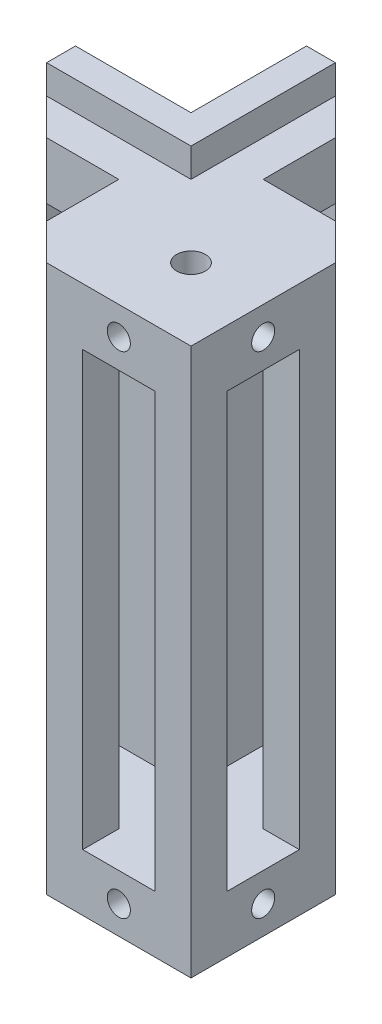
ISO-10303-21;
HEADER;
FILE_DESCRIPTION(('STEP AP214'),'2;1');
FILE_NAME('part.step','',(''),(''),'','','');
FILE_SCHEMA(('AUTOMOTIVE_DESIGN { 1 0 10303 214 1 1 1 1 }'));
ENDSEC;
DATA;
#1=APPLICATION_CONTEXT('core data for automotive mechanical design processes');
#2=APPLICATION_PROTOCOL_DEFINITION('international standard','automotive_design',2000,#1);
#3=PRODUCT_CONTEXT('',#1,'mechanical');
#4=PRODUCT('Part','Part','',(#3));
#5=PRODUCT_RELATED_PRODUCT_CATEGORY('part','',(#4));
#6=PRODUCT_DEFINITION_FORMATION('','',#4);
#7=PRODUCT_DEFINITION_CONTEXT('part definition',#1,'design');
#8=PRODUCT_DEFINITION('design','',#6,#7);
#9=PRODUCT_DEFINITION_SHAPE('','',#8);
#10=(LENGTH_UNIT() NAMED_UNIT(*) SI_UNIT(.MILLI.,.METRE.));
#11=(NAMED_UNIT(*) PLANE_ANGLE_UNIT() SI_UNIT($,.RADIAN.));
#12=(NAMED_UNIT(*) SI_UNIT($,.STERADIAN.) SOLID_ANGLE_UNIT());
#13=UNCERTAINTY_MEASURE_WITH_UNIT(LENGTH_MEASURE(1.E-05),#10,'distance_accuracy_value','');
#14=(GEOMETRIC_REPRESENTATION_CONTEXT(3) GLOBAL_UNCERTAINTY_ASSIGNED_CONTEXT((#13)) GLOBAL_UNIT_ASSIGNED_CONTEXT((#10,
#11,#12)) REPRESENTATION_CONTEXT('',''));
#15=CARTESIAN_POINT('',(0.,0.,0.));
#16=DIRECTION('',(0.,0.,1.));
#17=DIRECTION('',(1.,0.,0.));
#18=AXIS2_PLACEMENT_3D('',#15,#16,#17);
#19=CARTESIAN_POINT('',(2.5,-37.9,-7.5));
#20=DIRECTION('',(-1.,0.,0.));
#21=DIRECTION('',(0.,0.,1.));
#22=AXIS2_PLACEMENT_3D('',#19,#20,#21);
#23=PLANE('',#22);
#24=DIRECTION('',(0.,0.,1.));
#25=VECTOR('',#24,1.);
#26=CARTESIAN_POINT('',(2.5,-3.95,-20.));
#27=LINE('',#26,#25);
#28=CARTESIAN_POINT('',(2.5,-3.95,-12.));
#29=VERTEX_POINT('',#28);
#30=CARTESIAN_POINT('',(2.5,-3.95,-7.5));
#31=VERTEX_POINT('',#30);
#32=EDGE_CURVE('E435',#29,#31,#27,.T.);
#33=ORIENTED_EDGE('',*,*,#32,.T.);
#34=DIRECTION('',(0.,-1.,0.));
#35=VECTOR('',#34,1.);
#36=CARTESIAN_POINT('',(2.5,-37.9,-7.5));
#37=LINE('',#36,#35);
#38=CARTESIAN_POINT('',(2.5,-33.95,-7.5));
#39=VERTEX_POINT('',#38);
#40=EDGE_CURVE('E716',#31,#39,#37,.T.);
#41=ORIENTED_EDGE('',*,*,#40,.T.);
#42=DIRECTION('',(0.,0.,1.));
#43=VECTOR('',#42,1.);
#44=CARTESIAN_POINT('',(2.5,-33.95,-20.));
#45=LINE('',#44,#43);
#46=CARTESIAN_POINT('',(2.5,-33.95,-12.));
#47=VERTEX_POINT('',#46);
#48=EDGE_CURVE('E434',#47,#39,#45,.T.);
#49=ORIENTED_EDGE('',*,*,#48,.F.);
#50=DIRECTION('',(0.,1.,0.));
#51=VECTOR('',#50,1.);
#52=CARTESIAN_POINT('',(2.5,-39.9,-12.));
#53=LINE('',#52,#51);
#54=EDGE_CURVE('E337',#47,#29,#53,.T.);
#55=ORIENTED_EDGE('',*,*,#54,.T.);
#56=EDGE_LOOP('',(#33,#41,#49,#55));
#57=FACE_BOUND('',#56,.T.);
#58=ADVANCED_FACE('F38',(#57),#23,.F.);
#59=CARTESIAN_POINT('',(7.5,-37.9,-7.5));
#60=DIRECTION('',(1.,0.,0.));
#61=DIRECTION('',(0.,0.,-1.));
#62=AXIS2_PLACEMENT_3D('',#59,#60,#61);
#63=PLANE('',#62);
#64=DIRECTION('',(0.,0.,1.));
#65=VECTOR('',#64,1.);
#66=CARTESIAN_POINT('',(7.5,-33.95,-20.));
#67=LINE('',#66,#65);
#68=CARTESIAN_POINT('',(7.5,-33.95,-12.));
#69=VERTEX_POINT('',#68);
#70=CARTESIAN_POINT('',(7.5,-33.95,-7.5));
#71=VERTEX_POINT('',#70);
#72=EDGE_CURVE('E444',#69,#71,#67,.T.);
#73=ORIENTED_EDGE('',*,*,#72,.T.);
#74=DIRECTION('',(0.,1.,0.));
#75=VECTOR('',#74,1.);
#76=CARTESIAN_POINT('',(7.5,-37.9,-7.5));
#77=LINE('',#76,#75);
#78=CARTESIAN_POINT('',(7.5,-3.95,-7.5));
#79=VERTEX_POINT('',#78);
#80=EDGE_CURVE('E712',#71,#79,#77,.T.);
#81=ORIENTED_EDGE('',*,*,#80,.T.);
#82=DIRECTION('',(0.,0.,1.));
#83=VECTOR('',#82,1.);
#84=CARTESIAN_POINT('',(7.5,-3.95,-20.));
#85=LINE('',#84,#83);
#86=CARTESIAN_POINT('',(7.5,-3.95,-12.));
#87=VERTEX_POINT('',#86);
#88=EDGE_CURVE('E440',#87,#79,#85,.T.);
#89=ORIENTED_EDGE('',*,*,#88,.F.);
#90=DIRECTION('',(0.,-1.,0.));
#91=VECTOR('',#90,1.);
#92=CARTESIAN_POINT('',(7.5,-39.9,-12.));
#93=LINE('',#92,#91);
#94=EDGE_CURVE('E330',#87,#69,#93,.T.);
#95=ORIENTED_EDGE('',*,*,#94,.T.);
#96=EDGE_LOOP('',(#73,#81,#89,#95));
#97=FACE_BOUND('',#96,.T.);
#98=ADVANCED_FACE('F775',(#97),#63,.F.);
#99=DIRECTION('',(0.,1.,0.));
#100=VECTOR('',#99,1.);
#101=CARTESIAN_POINT('',(7.5,-37.9,-7.5));
#102=LINE('',#101,#100);
#103=CARTESIAN_POINT('',(7.5,0.,-7.5));
#104=VERTEX_POINT('',#103);
#105=EDGE_CURVE('E584',#79,#104,#102,.T.);
#106=ORIENTED_EDGE('',*,*,#105,.F.);
#107=DIRECTION('',(0.,0.,1.));
#108=VECTOR('',#107,1.);
#109=CARTESIAN_POINT('',(7.5,-3.95,-7.5));
#110=LINE('',#109,#108);
#111=CARTESIAN_POINT('',(7.5,-3.95,-2.5));
#112=VERTEX_POINT('',#111);
#113=EDGE_CURVE('E704',#79,#112,#110,.T.);
#114=ORIENTED_EDGE('',*,*,#113,.T.);
#115=DIRECTION('',(0.,1.,0.));
#116=VECTOR('',#115,1.);
#117=CARTESIAN_POINT('',(7.5,-37.9,-2.5));
#118=LINE('',#117,#116);
#119=CARTESIAN_POINT('',(7.5,0.,-2.5));
#120=VERTEX_POINT('',#119);
#121=EDGE_CURVE('E568',#112,#120,#118,.T.);
#122=ORIENTED_EDGE('',*,*,#121,.T.);
#123=DIRECTION('',(0.,0.,-1.));
#124=VECTOR('',#123,1.);
#125=CARTESIAN_POINT('',(7.5,0.,-7.5));
#126=LINE('',#125,#124);
#127=EDGE_CURVE('E550',#120,#104,#126,.T.);
#128=ORIENTED_EDGE('',*,*,#127,.T.);
#129=EDGE_LOOP('',(#106,#114,#122,#128));
#130=FACE_BOUND('',#129,.T.);
#131=ADVANCED_FACE('F781',(#130),#63,.F.);
#132=CARTESIAN_POINT('',(12.5,-3.95,0.));
#133=DIRECTION('',(-1.,0.,0.));
#134=DIRECTION('',(0.,0.,1.));
#135=AXIS2_PLACEMENT_3D('',#132,#133,#134);
#136=PLANE('',#135);
#137=DIRECTION('',(0.,0.,-1.));
#138=VECTOR('',#137,1.);
#139=CARTESIAN_POINT('',(12.5,-3.95,0.));
#140=LINE('',#139,#138);
#141=CARTESIAN_POINT('',(12.5,-3.95,-7.5));
#142=VERTEX_POINT('',#141);
#143=CARTESIAN_POINT('',(12.5,-3.95,-12.5));
#144=VERTEX_POINT('',#143);
#145=EDGE_CURVE('E737',#142,#144,#140,.T.);
#146=ORIENTED_EDGE('',*,*,#145,.F.);
#147=DIRECTION('',(0.,-1.,0.));
#148=VECTOR('',#147,1.);
#149=CARTESIAN_POINT('',(12.5,-3.95,-7.5));
#150=LINE('',#149,#148);
#151=CARTESIAN_POINT('',(12.5,-33.95,-7.5));
#152=VERTEX_POINT('',#151);
#153=EDGE_CURVE('E708',#142,#152,#150,.T.);
#154=ORIENTED_EDGE('',*,*,#153,.T.);
#155=DIRECTION('',(0.,0.,-1.));
#156=VECTOR('',#155,1.);
#157=CARTESIAN_POINT('',(12.5,-33.95,0.));
#158=LINE('',#157,#156);
#159=CARTESIAN_POINT('',(12.5,-33.95,-12.5));
#160=VERTEX_POINT('',#159);
#161=EDGE_CURVE('E380',#152,#160,#158,.T.);
#162=ORIENTED_EDGE('',*,*,#161,.T.);
#163=DIRECTION('',(0.,-1.,0.));
#164=VECTOR('',#163,1.);
#165=CARTESIAN_POINT('',(12.5,-37.9,-12.5));
#166=LINE('',#165,#164);
#167=EDGE_CURVE('E394',#144,#160,#166,.T.);
#168=ORIENTED_EDGE('',*,*,#167,.F.);
#169=EDGE_LOOP('',(#146,#154,#162,#168));
#170=FACE_BOUND('',#169,.T.);
#171=ADVANCED_FACE('F956',(#170),#136,.F.);
#172=CARTESIAN_POINT('',(17.5,-3.95,0.));
#173=DIRECTION('',(1.,0.,0.));
#174=DIRECTION('',(0.,0.,-1.));
#175=AXIS2_PLACEMENT_3D('',#172,#173,#174);
#176=PLANE('',#175);
#177=DIRECTION('',(0.,0.,-1.));
#178=VECTOR('',#177,1.);
#179=CARTESIAN_POINT('',(17.5,-33.95,0.));
#180=LINE('',#179,#178);
#181=CARTESIAN_POINT('',(17.5,-33.95,-7.5));
#182=VERTEX_POINT('',#181);
#183=CARTESIAN_POINT('',(17.5,-33.95,-12.5));
#184=VERTEX_POINT('',#183);
#185=EDGE_CURVE('E381',#182,#184,#180,.T.);
#186=ORIENTED_EDGE('',*,*,#185,.F.);
#187=DIRECTION('',(0.,1.,0.));
#188=VECTOR('',#187,1.);
#189=CARTESIAN_POINT('',(17.5,-3.95,-7.5));
#190=LINE('',#189,#188);
#191=CARTESIAN_POINT('',(17.5,-3.95,-7.5));
#192=VERTEX_POINT('',#191);
#193=EDGE_CURVE('E11',#182,#192,#190,.T.);
#194=ORIENTED_EDGE('',*,*,#193,.T.);
#195=DIRECTION('',(0.,0.,-1.));
#196=VECTOR('',#195,1.);
#197=CARTESIAN_POINT('',(17.5,-3.95,0.));
#198=LINE('',#197,#196);
#199=CARTESIAN_POINT('',(17.5,-3.95,-12.5));
#200=VERTEX_POINT('',#199);
#201=EDGE_CURVE('E733',#192,#200,#198,.T.);
#202=ORIENTED_EDGE('',*,*,#201,.T.);
#203=DIRECTION('',(0.,1.,0.));
#204=VECTOR('',#203,1.);
#205=CARTESIAN_POINT('',(17.5,-37.9,-12.5));
#206=LINE('',#205,#204);
#207=EDGE_CURVE('E391',#184,#200,#206,.T.);
#208=ORIENTED_EDGE('',*,*,#207,.F.);
#209=EDGE_LOOP('',(#186,#194,#202,#208));
#210=FACE_BOUND('',#209,.T.);
#211=ADVANCED_FACE('F770',(#210),#176,.F.);
#212=CARTESIAN_POINT('',(15.,-37.9,-5.));
#213=DIRECTION('',(0.,1.,0.));
#214=DIRECTION('',(0.,0.,1.));
#215=AXIS2_PLACEMENT_3D('',#212,#213,#214);
#216=CYLINDRICAL_SURFACE('',#215,1.);
#217=CARTESIAN_POINT('',(15.,-3.95,-5.));
#218=DIRECTION('',(0.,1.,0.));
#219=DIRECTION('',(-1.,0.,0.));
#220=AXIS2_PLACEMENT_3D('',#217,#218,#219);
#221=CIRCLE('',#220,1.);
#222=CARTESIAN_POINT('',(14.,-3.95,-5.));
#223=VERTEX_POINT('',#222);
#224=EDGE_CURVE('E406',#223,#223,#221,.F.);
#225=ORIENTED_EDGE('',*,*,#224,.T.);
#226=EDGE_LOOP('',(#225));
#227=FACE_BOUND('',#226,.T.);
#228=CARTESIAN_POINT('',(15.,0.,-5.));
#229=DIRECTION('',(0.,1.,0.));
#230=DIRECTION('',(0.,0.,1.));
#231=AXIS2_PLACEMENT_3D('',#228,#229,#230);
#232=CIRCLE('',#231,1.);
#233=CARTESIAN_POINT('',(15.,0.,-4.));
#234=VERTEX_POINT('',#233);
#235=EDGE_CURVE('E578',#234,#234,#232,.T.);
#236=ORIENTED_EDGE('',*,*,#235,.T.);
#237=EDGE_LOOP('',(#236));
#238=FACE_BOUND('',#237,.T.);
#239=ADVANCED_FACE('F792',(#227,#238),#216,.F.);
#240=CARTESIAN_POINT('',(12.5,-37.9,-17.5));
#241=DIRECTION('',(0.,0.,-1.));
#242=DIRECTION('',(-1.,0.,0.));
#243=AXIS2_PLACEMENT_3D('',#240,#241,#242);
#244=PLANE('',#243);
#245=DIRECTION('',(1.,0.,0.));
#246=VECTOR('',#245,1.);
#247=CARTESIAN_POINT('',(0.,-33.95,-17.5));
#248=LINE('',#247,#246);
#249=CARTESIAN_POINT('',(8.,-33.95,-17.5));
#250=VERTEX_POINT('',#249);
#251=CARTESIAN_POINT('',(12.5,-33.95,-17.5));
#252=VERTEX_POINT('',#251);
#253=EDGE_CURVE('E420',#250,#252,#248,.T.);
#254=ORIENTED_EDGE('',*,*,#253,.T.);
#255=DIRECTION('',(0.,1.,0.));
#256=VECTOR('',#255,1.);
#257=CARTESIAN_POINT('',(12.5,-37.9,-17.5));
#258=LINE('',#257,#256);
#259=CARTESIAN_POINT('',(12.5,-3.95,-17.5));
#260=VERTEX_POINT('',#259);
#261=EDGE_CURVE('E398',#252,#260,#258,.T.);
#262=ORIENTED_EDGE('',*,*,#261,.T.);
#263=DIRECTION('',(1.,0.,0.));
#264=VECTOR('',#263,1.);
#265=CARTESIAN_POINT('',(0.,-3.94999999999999,-17.5));
#266=LINE('',#265,#264);
#267=CARTESIAN_POINT('',(8.,-3.94999999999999,-17.5));
#268=VERTEX_POINT('',#267);
#269=EDGE_CURVE('E416',#268,#260,#266,.T.);
#270=ORIENTED_EDGE('',*,*,#269,.F.);
#271=DIRECTION('',(0.,-1.,0.));
#272=VECTOR('',#271,1.);
#273=CARTESIAN_POINT('',(8.,-39.9,-17.5));
#274=LINE('',#273,#272);
#275=EDGE_CURVE('E343',#268,#250,#274,.T.);
#276=ORIENTED_EDGE('',*,*,#275,.T.);
#277=EDGE_LOOP('',(#254,#262,#270,#276));
#278=FACE_BOUND('',#277,.T.);
#279=ADVANCED_FACE('F941',(#278),#244,.F.);
#280=CARTESIAN_POINT('',(12.5,-37.9,-12.5));
#281=DIRECTION('',(0.,0.,1.));
#282=DIRECTION('',(1.,0.,0.));
#283=AXIS2_PLACEMENT_3D('',#280,#281,#282);
#284=PLANE('',#283);
#285=DIRECTION('',(0.,1.,0.));
#286=VECTOR('',#285,1.);
#287=CARTESIAN_POINT('',(17.5,-37.9,-12.5));
#288=LINE('',#287,#286);
#289=CARTESIAN_POINT('',(17.5,0.,-12.5));
#290=VERTEX_POINT('',#289);
#291=EDGE_CURVE('E279',#200,#290,#288,.T.);
#292=ORIENTED_EDGE('',*,*,#291,.F.);
#293=DIRECTION('',(-1.,0.,0.));
#294=VECTOR('',#293,1.);
#295=CARTESIAN_POINT('',(12.5,-3.95,-12.5));
#296=LINE('',#295,#294);
#297=EDGE_CURVE('E357',#200,#144,#296,.T.);
#298=ORIENTED_EDGE('',*,*,#297,.T.);
#299=DIRECTION('',(0.,1.,0.));
#300=VECTOR('',#299,1.);
#301=CARTESIAN_POINT('',(12.5,-37.9,-12.5));
#302=LINE('',#301,#300);
#303=CARTESIAN_POINT('',(12.5,0.,-12.5));
#304=VERTEX_POINT('',#303);
#305=EDGE_CURVE('E540',#144,#304,#302,.T.);
#306=ORIENTED_EDGE('',*,*,#305,.T.);
#307=DIRECTION('',(1.,0.,0.));
#308=VECTOR('',#307,1.);
#309=CARTESIAN_POINT('',(12.5,0.,-12.5));
#310=LINE('',#309,#308);
#311=EDGE_CURVE('E536',#304,#290,#310,.T.);
#312=ORIENTED_EDGE('',*,*,#311,.T.);
#313=EDGE_LOOP('',(#292,#298,#306,#312));
#314=FACE_BOUND('',#313,.T.);
#315=ADVANCED_FACE('F960',(#314),#284,.F.);
#316=DIRECTION('',(1.,0.,0.));
#317=VECTOR('',#316,1.);
#318=CARTESIAN_POINT('',(0.,-3.94999999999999,-12.5));
#319=LINE('',#318,#317);
#320=CARTESIAN_POINT('',(8.,-3.94999999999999,-12.5));
#321=VERTEX_POINT('',#320);
#322=EDGE_CURVE('E411',#321,#144,#319,.T.);
#323=ORIENTED_EDGE('',*,*,#322,.T.);
#324=ORIENTED_EDGE('',*,*,#167,.T.);
#325=DIRECTION('',(1.,0.,0.));
#326=VECTOR('',#325,1.);
#327=CARTESIAN_POINT('',(0.,-33.95,-12.5));
#328=LINE('',#327,#326);
#329=CARTESIAN_POINT('',(8.,-33.95,-12.5));
#330=VERTEX_POINT('',#329);
#331=EDGE_CURVE('E410',#330,#160,#328,.T.);
#332=ORIENTED_EDGE('',*,*,#331,.F.);
#333=DIRECTION('',(0.,1.,0.));
#334=VECTOR('',#333,1.);
#335=CARTESIAN_POINT('',(8.,-39.9,-12.5));
#336=LINE('',#335,#334);
#337=EDGE_CURVE('E350',#330,#321,#336,.T.);
#338=ORIENTED_EDGE('',*,*,#337,.T.);
#339=EDGE_LOOP('',(#323,#324,#332,#338));
#340=FACE_BOUND('',#339,.T.);
#341=ADVANCED_FACE('F954',(#340),#284,.F.);
#342=CARTESIAN_POINT('',(12.5,-37.9,-17.5));
#343=DIRECTION('',(-1.,0.,0.));
#344=DIRECTION('',(0.,0.,1.));
#345=AXIS2_PLACEMENT_3D('',#342,#343,#344);
#346=PLANE('',#345);
#347=ORIENTED_EDGE('',*,*,#305,.F.);
#348=DIRECTION('',(0.,0.,-1.));
#349=VECTOR('',#348,1.);
#350=CARTESIAN_POINT('',(12.5,-3.95,-17.5));
#351=LINE('',#350,#349);
#352=EDGE_CURVE('E430',#144,#260,#351,.T.);
#353=ORIENTED_EDGE('',*,*,#352,.T.);
#354=DIRECTION('',(0.,1.,0.));
#355=VECTOR('',#354,1.);
#356=CARTESIAN_POINT('',(12.5,-37.9,-17.5));
#357=LINE('',#356,#355);
#358=CARTESIAN_POINT('',(12.5,0.,-17.5));
#359=VERTEX_POINT('',#358);
#360=EDGE_CURVE('E551',#260,#359,#357,.T.);
#361=ORIENTED_EDGE('',*,*,#360,.T.);
#362=DIRECTION('',(0.,0.,1.));
#363=VECTOR('',#362,1.);
#364=CARTESIAN_POINT('',(12.5,0.,-17.5));
#365=LINE('',#364,#363);
#366=EDGE_CURVE('E511',#359,#304,#365,.T.);
#367=ORIENTED_EDGE('',*,*,#366,.T.);
#368=EDGE_LOOP('',(#347,#353,#361,#367));
#369=FACE_BOUND('',#368,.T.);
#370=ADVANCED_FACE('F937',(#369),#346,.F.);
#371=CARTESIAN_POINT('',(2.5,-37.9,-7.5));
#372=DIRECTION('',(0.,0.,-1.));
#373=DIRECTION('',(-1.,0.,0.));
#374=AXIS2_PLACEMENT_3D('',#371,#372,#373);
#375=PLANE('',#374);
#376=DIRECTION('',(0.,1.,0.));
#377=VECTOR('',#376,1.);
#378=CARTESIAN_POINT('',(2.5,-37.9,-7.5));
#379=LINE('',#378,#377);
#380=CARTESIAN_POINT('',(2.5,0.,-7.5));
#381=VERTEX_POINT('',#380);
#382=EDGE_CURVE('E579',#31,#381,#379,.T.);
#383=ORIENTED_EDGE('',*,*,#382,.F.);
#384=DIRECTION('',(1.,0.,0.));
#385=VECTOR('',#384,1.);
#386=CARTESIAN_POINT('',(2.50000000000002,-3.95,-7.5));
#387=LINE('',#386,#385);
#388=EDGE_CURVE('E454',#31,#79,#387,.T.);
#389=ORIENTED_EDGE('',*,*,#388,.T.);
#390=ORIENTED_EDGE('',*,*,#105,.T.);
#391=DIRECTION('',(-1.,0.,0.));
#392=VECTOR('',#391,1.);
#393=CARTESIAN_POINT('',(2.5,0.,-7.5));
#394=LINE('',#393,#392);
#395=EDGE_CURVE('E564',#104,#381,#394,.T.);
#396=ORIENTED_EDGE('',*,*,#395,.T.);
#397=EDGE_LOOP('',(#383,#389,#390,#396));
#398=FACE_BOUND('',#397,.T.);
#399=ADVANCED_FACE('F903',(#398),#375,.F.);
#400=CARTESIAN_POINT('',(0.,-37.9,-10.));
#401=DIRECTION('',(-1.,0.,0.));
#402=DIRECTION('',(0.,0.,1.));
#403=AXIS2_PLACEMENT_3D('',#400,#401,#402);
#404=PLANE('',#403);
#405=DIRECTION('',(0.,1.,0.));
#406=VECTOR('',#405,1.);
#407=CARTESIAN_POINT('',(0.,-39.9,-10.));
#408=LINE('',#407,#406);
#409=CARTESIAN_POINT('',(0.,-37.9,-10.));
#410=VERTEX_POINT('',#409);
#411=CARTESIAN_POINT('',(0.,0.,-10.));
#412=VERTEX_POINT('',#411);
#413=EDGE_CURVE('E612',#410,#412,#408,.T.);
#414=ORIENTED_EDGE('',*,*,#413,.T.);
#415=DIRECTION('',(0.,1.,0.));
#416=VECTOR('',#415,1.);
#417=CARTESIAN_POINT('',(0.,-39.9,-10.));
#418=LINE('',#417,#416);
#419=CARTESIAN_POINT('',(0.,2.,-10.));
#420=VERTEX_POINT('',#419);
#421=EDGE_CURVE('E512',#412,#420,#418,.T.);
#422=ORIENTED_EDGE('',*,*,#421,.T.);
#423=DIRECTION('',(0.,0.,1.));
#424=VECTOR('',#423,1.);
#425=CARTESIAN_POINT('',(0.,2.,-10.));
#426=LINE('',#425,#424);
#427=CARTESIAN_POINT('',(0.,2.,-12.));
#428=VERTEX_POINT('',#427);
#429=EDGE_CURVE('E478',#428,#420,#426,.T.);
#430=ORIENTED_EDGE('',*,*,#429,.F.);
#431=DIRECTION('',(0.,1.,0.));
#432=VECTOR('',#431,1.);
#433=CARTESIAN_POINT('',(0.,-39.9,-12.));
#434=LINE('',#433,#432);
#435=CARTESIAN_POINT('',(0.,-39.9,-12.));
#436=VERTEX_POINT('',#435);
#437=EDGE_CURVE('E513',#436,#428,#434,.T.);
#438=ORIENTED_EDGE('',*,*,#437,.F.);
#439=DIRECTION('',(0.,0.,1.));
#440=VECTOR('',#439,1.);
#441=CARTESIAN_POINT('',(0.,-39.9,-10.));
#442=LINE('',#441,#440);
#443=CARTESIAN_POINT('',(0.,-39.9,-10.));
#444=VERTEX_POINT('',#443);
#445=EDGE_CURVE('E502',#436,#444,#442,.T.);
#446=ORIENTED_EDGE('',*,*,#445,.T.);
#447=EDGE_CURVE('E507',#444,#410,#418,.T.);
#448=ORIENTED_EDGE('',*,*,#447,.T.);
#449=EDGE_LOOP('',(#414,#422,#430,#438,#446,#448));
#450=FACE_BOUND('',#449,.T.);
#451=ADVANCED_FACE('F40',(#450),#404,.T.);
#452=CARTESIAN_POINT('',(20.,-37.9,-20.));
#453=DIRECTION('',(0.,0.,-1.));
#454=DIRECTION('',(-1.,0.,0.));
#455=AXIS2_PLACEMENT_3D('',#452,#453,#454);
#456=PLANE('',#455);
#457=DIRECTION('',(0.,1.,0.));
#458=VECTOR('',#457,1.);
#459=CARTESIAN_POINT('',(10.,-39.9,-20.));
#460=LINE('',#459,#458);
#461=CARTESIAN_POINT('',(10.,-37.9,-20.));
#462=VERTEX_POINT('',#461);
#463=CARTESIAN_POINT('',(10.,0.,-20.));
#464=VERTEX_POINT('',#463);
#465=EDGE_CURVE('E298',#462,#464,#460,.T.);
#466=ORIENTED_EDGE('',*,*,#465,.F.);
#467=DIRECTION('',(0.,1.,0.));
#468=VECTOR('',#467,1.);
#469=CARTESIAN_POINT('',(10.,-39.9,-20.));
#470=LINE('',#469,#468);
#471=CARTESIAN_POINT('',(10.,-39.9,-20.));
#472=VERTEX_POINT('',#471);
#473=EDGE_CURVE('E522',#472,#462,#470,.T.);
#474=ORIENTED_EDGE('',*,*,#473,.F.);
#475=DIRECTION('',(-1.,0.,0.));
#476=VECTOR('',#475,1.);
#477=CARTESIAN_POINT('',(10.,-39.9,-20.));
#478=LINE('',#477,#476);
#479=CARTESIAN_POINT('',(8.,-39.9,-20.));
#480=VERTEX_POINT('',#479);
#481=EDGE_CURVE('E490',#472,#480,#478,.T.);
#482=ORIENTED_EDGE('',*,*,#481,.T.);
#483=DIRECTION('',(0.,1.,0.));
#484=VECTOR('',#483,1.);
#485=CARTESIAN_POINT('',(8.,-39.9,-20.));
#486=LINE('',#485,#484);
#487=CARTESIAN_POINT('',(8.,2.,-20.));
#488=VERTEX_POINT('',#487);
#489=EDGE_CURVE('E519',#480,#488,#486,.T.);
#490=ORIENTED_EDGE('',*,*,#489,.T.);
#491=DIRECTION('',(-1.,0.,0.));
#492=VECTOR('',#491,1.);
#493=CARTESIAN_POINT('',(10.,2.,-20.));
#494=LINE('',#493,#492);
#495=CARTESIAN_POINT('',(10.,2.,-20.));
#496=VERTEX_POINT('',#495);
#497=EDGE_CURVE('E466',#496,#488,#494,.T.);
#498=ORIENTED_EDGE('',*,*,#497,.F.);
#499=EDGE_CURVE('E526',#464,#496,#470,.T.);
#500=ORIENTED_EDGE('',*,*,#499,.F.);
#501=EDGE_LOOP('',(#466,#474,#482,#490,#498,#500));
#502=FACE_BOUND('',#501,.T.);
#503=ADVANCED_FACE('F797',(#502),#456,.T.);
#504=CARTESIAN_POINT('',(20.,-37.9,0.));
#505=DIRECTION('',(1.,0.,0.));
#506=DIRECTION('',(0.,0.,-1.));
#507=AXIS2_PLACEMENT_3D('',#504,#505,#506);
#508=PLANE('',#507);
#509=CARTESIAN_POINT('',(20.,-1.95,-5.));
#510=DIRECTION('',(1.,0.,0.));
#511=DIRECTION('',(0.,0.,-1.));
#512=AXIS2_PLACEMENT_3D('',#509,#510,#511);
#513=CIRCLE('',#512,0.8);
#514=CARTESIAN_POINT('',(20.,-1.95,-5.8));
#515=VERTEX_POINT('',#514);
#516=EDGE_CURVE('E864',#515,#515,#513,.T.);
#517=ORIENTED_EDGE('',*,*,#516,.F.);
#518=EDGE_LOOP('',(#517));
#519=FACE_BOUND('',#518,.T.);
#520=CARTESIAN_POINT('',(20.,-35.95,-5.));
#521=DIRECTION('',(1.,0.,0.));
#522=DIRECTION('',(0.,0.,-1.));
#523=AXIS2_PLACEMENT_3D('',#520,#521,#522);
#524=CIRCLE('',#523,0.800000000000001);
#525=CARTESIAN_POINT('',(20.,-35.95,-5.80000000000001));
#526=VERTEX_POINT('',#525);
#527=EDGE_CURVE('E874',#526,#526,#524,.T.);
#528=ORIENTED_EDGE('',*,*,#527,.F.);
#529=EDGE_LOOP('',(#528));
#530=FACE_BOUND('',#529,.T.);
#531=DIRECTION('',(0.,1.,0.));
#532=VECTOR('',#531,1.);
#533=CARTESIAN_POINT('',(20.,-39.9,-10.));
#534=LINE('',#533,#532);
#535=CARTESIAN_POINT('',(20.,-37.9,-10.));
#536=VERTEX_POINT('',#535);
#537=CARTESIAN_POINT('',(20.,0.,-10.));
#538=VERTEX_POINT('',#537);
#539=EDGE_CURVE('E276',#536,#538,#534,.T.);
#540=ORIENTED_EDGE('',*,*,#539,.T.);
#541=DIRECTION('',(0.,0.,-1.));
#542=VECTOR('',#541,1.);
#543=CARTESIAN_POINT('',(20.,0.,0.));
#544=LINE('',#543,#542);
#545=CARTESIAN_POINT('',(20.,0.,0.));
#546=VERTEX_POINT('',#545);
#547=EDGE_CURVE('E294',#546,#538,#544,.T.);
#548=ORIENTED_EDGE('',*,*,#547,.F.);
#549=DIRECTION('',(0.,1.,0.));
#550=VECTOR('',#549,1.);
#551=CARTESIAN_POINT('',(20.,-37.9,0.));
#552=LINE('',#551,#550);
#553=CARTESIAN_POINT('',(20.,-37.9,0.));
#554=VERTEX_POINT('',#553);
#555=EDGE_CURVE('E323',#554,#546,#552,.T.);
#556=ORIENTED_EDGE('',*,*,#555,.F.);
#557=DIRECTION('',(0.,0.,-1.));
#558=VECTOR('',#557,1.);
#559=CARTESIAN_POINT('',(20.,-37.9,0.));
#560=LINE('',#559,#558);
#561=EDGE_CURVE('E296',#554,#536,#560,.T.);
#562=ORIENTED_EDGE('',*,*,#561,.T.);
#563=EDGE_LOOP('',(#540,#548,#556,#562));
#564=FACE_BOUND('',#563,.T.);
#565=DIRECTION('',(0.,-1.,0.));
#566=VECTOR('',#565,1.);
#567=CARTESIAN_POINT('',(20.,-3.95,-7.5));
#568=LINE('',#567,#566);
#569=CARTESIAN_POINT('',(20.,-3.95,-7.5));
#570=VERTEX_POINT('',#569);
#571=CARTESIAN_POINT('',(20.,-33.95,-7.5));
#572=VERTEX_POINT('',#571);
#573=EDGE_CURVE('E655',#570,#572,#568,.T.);
#574=ORIENTED_EDGE('',*,*,#573,.T.);
#575=DIRECTION('',(0.,0.,1.));
#576=VECTOR('',#575,1.);
#577=CARTESIAN_POINT('',(20.,-33.95,-7.5));
#578=LINE('',#577,#576);
#579=CARTESIAN_POINT('',(20.,-33.95,-2.5));
#580=VERTEX_POINT('',#579);
#581=EDGE_CURVE('E670',#572,#580,#578,.T.);
#582=ORIENTED_EDGE('',*,*,#581,.T.);
#583=DIRECTION('',(0.,1.,0.));
#584=VECTOR('',#583,1.);
#585=CARTESIAN_POINT('',(20.,-3.95,-2.5));
#586=LINE('',#585,#584);
#587=CARTESIAN_POINT('',(20.,-3.95,-2.5));
#588=VERTEX_POINT('',#587);
#589=EDGE_CURVE('E54',#580,#588,#586,.T.);
#590=ORIENTED_EDGE('',*,*,#589,.T.);
#591=DIRECTION('',(0.,0.,-1.));
#592=VECTOR('',#591,1.);
#593=CARTESIAN_POINT('',(20.,-3.95,-7.5));
#594=LINE('',#593,#592);
#595=EDGE_CURVE('E675',#588,#570,#594,.T.);
#596=ORIENTED_EDGE('',*,*,#595,.T.);
#597=EDGE_LOOP('',(#574,#582,#590,#596));
#598=FACE_BOUND('',#597,.T.);
#599=ADVANCED_FACE('F291',(#519,#530,#564,#598),#508,.T.);
#600=CARTESIAN_POINT('',(0.,-37.9,0.));
#601=DIRECTION('',(0.,0.,1.));
#602=DIRECTION('',(1.,0.,0.));
#603=AXIS2_PLACEMENT_3D('',#600,#601,#602);
#604=PLANE('',#603);
#605=DIRECTION('',(0.,1.,0.));
#606=VECTOR('',#605,1.);
#607=CARTESIAN_POINT('',(10.,-39.9,0.));
#608=LINE('',#607,#606);
#609=CARTESIAN_POINT('',(10.,-37.9,0.));
#610=VERTEX_POINT('',#609);
#611=CARTESIAN_POINT('',(10.,0.,0.));
#612=VERTEX_POINT('',#611);
#613=EDGE_CURVE('E810',#610,#612,#608,.T.);
#614=ORIENTED_EDGE('',*,*,#613,.F.);
#615=DIRECTION('',(1.,0.,0.));
#616=VECTOR('',#615,1.);
#617=CARTESIAN_POINT('',(0.,-37.9,0.));
#618=LINE('',#617,#616);
#619=EDGE_CURVE('E322',#610,#554,#618,.T.);
#620=ORIENTED_EDGE('',*,*,#619,.T.);
#621=ORIENTED_EDGE('',*,*,#555,.T.);
#622=DIRECTION('',(1.,0.,0.));
#623=VECTOR('',#622,1.);
#624=CARTESIAN_POINT('',(0.,0.,0.));
#625=LINE('',#624,#623);
#626=EDGE_CURVE('E305',#612,#546,#625,.T.);
#627=ORIENTED_EDGE('',*,*,#626,.F.);
#628=EDGE_LOOP('',(#614,#620,#621,#627));
#629=FACE_BOUND('',#628,.T.);
#630=CARTESIAN_POINT('',(15.,-1.95,0.));
#631=DIRECTION('',(0.,0.,1.));
#632=DIRECTION('',(1.,0.,0.));
#633=AXIS2_PLACEMENT_3D('',#630,#631,#632);
#634=CIRCLE('',#633,0.800000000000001);
#635=CARTESIAN_POINT('',(15.8,-1.95,0.));
#636=VERTEX_POINT('',#635);
#637=EDGE_CURVE('E656',#636,#636,#634,.T.);
#638=ORIENTED_EDGE('',*,*,#637,.F.);
#639=EDGE_LOOP('',(#638));
#640=FACE_BOUND('',#639,.T.);
#641=CARTESIAN_POINT('',(15.,-35.95,0.));
#642=DIRECTION('',(0.,0.,1.));
#643=DIRECTION('',(1.,0.,0.));
#644=AXIS2_PLACEMENT_3D('',#641,#642,#643);
#645=CIRCLE('',#644,0.8);
#646=CARTESIAN_POINT('',(15.8,-35.95,0.));
#647=VERTEX_POINT('',#646);
#648=EDGE_CURVE('E632',#647,#647,#645,.T.);
#649=ORIENTED_EDGE('',*,*,#648,.F.);
#650=EDGE_LOOP('',(#649));
#651=FACE_BOUND('',#650,.T.);
#652=DIRECTION('',(0.,-1.,0.));
#653=VECTOR('',#652,1.);
#654=CARTESIAN_POINT('',(17.5,-3.95,0.));
#655=LINE('',#654,#653);
#656=CARTESIAN_POINT('',(17.5,-3.95,0.));
#657=VERTEX_POINT('',#656);
#658=CARTESIAN_POINT('',(17.5,-33.95,0.));
#659=VERTEX_POINT('',#658);
#660=EDGE_CURVE('E720',#657,#659,#655,.T.);
#661=ORIENTED_EDGE('',*,*,#660,.T.);
#662=DIRECTION('',(-1.,0.,0.));
#663=VECTOR('',#662,1.);
#664=CARTESIAN_POINT('',(17.5,-33.95,0.));
#665=LINE('',#664,#663);
#666=CARTESIAN_POINT('',(12.5,-33.95,0.));
#667=VERTEX_POINT('',#666);
#668=EDGE_CURVE('E377',#659,#667,#665,.T.);
#669=ORIENTED_EDGE('',*,*,#668,.T.);
#670=DIRECTION('',(0.,1.,0.));
#671=VECTOR('',#670,1.);
#672=CARTESIAN_POINT('',(12.5,-3.95,0.));
#673=LINE('',#672,#671);
#674=CARTESIAN_POINT('',(12.5,-3.95,0.));
#675=VERTEX_POINT('',#674);
#676=EDGE_CURVE('E725',#667,#675,#673,.T.);
#677=ORIENTED_EDGE('',*,*,#676,.T.);
#678=DIRECTION('',(1.,0.,0.));
#679=VECTOR('',#678,1.);
#680=CARTESIAN_POINT('',(17.5,-3.95,0.));
#681=LINE('',#680,#679);
#682=EDGE_CURVE('E388',#675,#657,#681,.T.);
#683=ORIENTED_EDGE('',*,*,#682,.T.);
#684=EDGE_LOOP('',(#661,#669,#677,#683));
#685=FACE_BOUND('',#684,.T.);
#686=ADVANCED_FACE('F753',(#629,#640,#651,#685),#604,.T.);
#687=CARTESIAN_POINT('',(0.,-37.9,0.));
#688=DIRECTION('',(0.,1.,0.));
#689=DIRECTION('',(0.,0.,1.));
#690=AXIS2_PLACEMENT_3D('',#687,#688,#689);
#691=PLANE('',#690);
#692=DIRECTION('',(0.,0.,1.));
#693=VECTOR('',#692,1.);
#694=CARTESIAN_POINT('',(10.,-37.9,-20.));
#695=LINE('',#694,#693);
#696=CARTESIAN_POINT('',(10.,-37.9,-10.));
#697=VERTEX_POINT('',#696);
#698=EDGE_CURVE('E599',#462,#697,#695,.T.);
#699=ORIENTED_EDGE('',*,*,#698,.F.);
#700=DIRECTION('',(0.707106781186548,0.,0.707106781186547));
#701=VECTOR('',#700,1.);
#702=CARTESIAN_POINT('',(15.,-37.9,-15.));
#703=LINE('',#702,#701);
#704=CARTESIAN_POINT('',(12.5,-37.9,-17.5));
#705=VERTEX_POINT('',#704);
#706=EDGE_CURVE('E627',#462,#705,#703,.T.);
#707=ORIENTED_EDGE('',*,*,#706,.T.);
#708=DIRECTION('',(0.,0.,1.));
#709=VECTOR('',#708,1.);
#710=CARTESIAN_POINT('',(12.5,-37.9,-17.5));
#711=LINE('',#710,#709);
#712=CARTESIAN_POINT('',(12.5,-37.9,-12.5));
#713=VERTEX_POINT('',#712);
#714=EDGE_CURVE('E531',#705,#713,#711,.T.);
#715=ORIENTED_EDGE('',*,*,#714,.T.);
#716=DIRECTION('',(1.,0.,0.));
#717=VECTOR('',#716,1.);
#718=CARTESIAN_POINT('',(12.5,-37.9,-12.5));
#719=LINE('',#718,#717);
#720=CARTESIAN_POINT('',(17.5,-37.9,-12.5));
#721=VERTEX_POINT('',#720);
#722=EDGE_CURVE('E535',#713,#721,#719,.T.);
#723=ORIENTED_EDGE('',*,*,#722,.T.);
#724=EDGE_CURVE('E633',#721,#536,#703,.T.);
#725=ORIENTED_EDGE('',*,*,#724,.T.);
#726=ORIENTED_EDGE('',*,*,#561,.F.);
#727=ORIENTED_EDGE('',*,*,#619,.F.);
#728=DIRECTION('',(-0.707106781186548,0.,-0.707106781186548));
#729=VECTOR('',#728,1.);
#730=CARTESIAN_POINT('',(5.,-37.9,-5.));
#731=LINE('',#730,#729);
#732=CARTESIAN_POINT('',(7.5,-37.9,-2.5));
#733=VERTEX_POINT('',#732);
#734=EDGE_CURVE('E644',#610,#733,#731,.T.);
#735=ORIENTED_EDGE('',*,*,#734,.T.);
#736=DIRECTION('',(0.,0.,-1.));
#737=VECTOR('',#736,1.);
#738=CARTESIAN_POINT('',(7.5,-37.9,-7.5));
#739=LINE('',#738,#737);
#740=CARTESIAN_POINT('',(7.5,-37.9,-7.5));
#741=VERTEX_POINT('',#740);
#742=EDGE_CURVE('E559',#733,#741,#739,.T.);
#743=ORIENTED_EDGE('',*,*,#742,.T.);
#744=DIRECTION('',(-1.,0.,0.));
#745=VECTOR('',#744,1.);
#746=CARTESIAN_POINT('',(2.5,-37.9,-7.5));
#747=LINE('',#746,#745);
#748=CARTESIAN_POINT('',(2.5,-37.9,-7.5));
#749=VERTEX_POINT('',#748);
#750=EDGE_CURVE('E563',#741,#749,#747,.T.);
#751=ORIENTED_EDGE('',*,*,#750,.T.);
#752=EDGE_CURVE('E647',#749,#410,#731,.T.);
#753=ORIENTED_EDGE('',*,*,#752,.T.);
#754=DIRECTION('',(-1.,0.,0.));
#755=VECTOR('',#754,1.);
#756=CARTESIAN_POINT('',(10.,-37.9,-10.));
#757=LINE('',#756,#755);
#758=EDGE_CURVE('E327',#697,#410,#757,.T.);
#759=ORIENTED_EDGE('',*,*,#758,.F.);
#760=EDGE_LOOP('',(#699,#707,#715,#723,#725,#726,#727,#735,#743,#751,#753,#759));
#761=FACE_BOUND('',#760,.T.);
#762=CARTESIAN_POINT('',(15.,-37.9,-5.));
#763=DIRECTION('',(0.,1.,0.));
#764=DIRECTION('',(0.,0.,1.));
#765=AXIS2_PLACEMENT_3D('',#762,#763,#764);
#766=CIRCLE('',#765,1.);
#767=CARTESIAN_POINT('',(15.,-37.9,-4.));
#768=VERTEX_POINT('',#767);
#769=EDGE_CURVE('E315',#768,#768,#766,.T.);
#770=ORIENTED_EDGE('',*,*,#769,.T.);
#771=EDGE_LOOP('',(#770));
#772=FACE_BOUND('',#771,.T.);
#773=ADVANCED_FACE('F625',(#761,#772),#691,.F.);
#774=CARTESIAN_POINT('',(0.,0.,0.));
#775=DIRECTION('',(0.,1.,0.));
#776=DIRECTION('',(0.,0.,1.));
#777=AXIS2_PLACEMENT_3D('',#774,#775,#776);
#778=PLANE('',#777);
#779=DIRECTION('',(0.707106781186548,0.,0.707106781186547));
#780=VECTOR('',#779,1.);
#781=CARTESIAN_POINT('',(10.,0.,-20.));
#782=LINE('',#781,#780);
#783=EDGE_CURVE('E285',#464,#359,#782,.T.);
#784=ORIENTED_EDGE('',*,*,#783,.F.);
#785=DIRECTION('',(0.,0.,1.));
#786=VECTOR('',#785,1.);
#787=CARTESIAN_POINT('',(10.,0.,-20.));
#788=LINE('',#787,#786);
#789=CARTESIAN_POINT('',(10.,0.,-10.));
#790=VERTEX_POINT('',#789);
#791=EDGE_CURVE('E308',#464,#790,#788,.T.);
#792=ORIENTED_EDGE('',*,*,#791,.T.);
#793=DIRECTION('',(-1.,0.,0.));
#794=VECTOR('',#793,1.);
#795=CARTESIAN_POINT('',(10.,0.,-10.));
#796=LINE('',#795,#794);
#797=EDGE_CURVE('E313',#790,#412,#796,.T.);
#798=ORIENTED_EDGE('',*,*,#797,.T.);
#799=DIRECTION('',(-0.707106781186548,0.,-0.707106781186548));
#800=VECTOR('',#799,1.);
#801=CARTESIAN_POINT('',(0.,0.,-10.));
#802=LINE('',#801,#800);
#803=EDGE_CURVE('E880',#381,#412,#802,.T.);
#804=ORIENTED_EDGE('',*,*,#803,.F.);
#805=ORIENTED_EDGE('',*,*,#395,.F.);
#806=ORIENTED_EDGE('',*,*,#127,.F.);
#807=EDGE_CURVE('E882',#612,#120,#802,.T.);
#808=ORIENTED_EDGE('',*,*,#807,.F.);
#809=ORIENTED_EDGE('',*,*,#626,.T.);
#810=ORIENTED_EDGE('',*,*,#547,.T.);
#811=EDGE_CURVE('E273',#290,#538,#782,.T.);
#812=ORIENTED_EDGE('',*,*,#811,.F.);
#813=ORIENTED_EDGE('',*,*,#311,.F.);
#814=ORIENTED_EDGE('',*,*,#366,.F.);
#815=EDGE_LOOP('',(#784,#792,#798,#804,#805,#806,#808,#809,#810,#812,#813,#814));
#816=FACE_BOUND('',#815,.T.);
#817=ORIENTED_EDGE('',*,*,#235,.F.);
#818=EDGE_LOOP('',(#817));
#819=FACE_BOUND('',#818,.T.);
#820=ADVANCED_FACE('F301',(#816,#819),#778,.T.);
#821=CARTESIAN_POINT('',(15.,-33.95,-5.));
#822=DIRECTION('',(0.,-1.,0.));
#823=DIRECTION('',(0.,0.,-1.));
#824=AXIS2_PLACEMENT_3D('',#821,#822,#823);
#825=CIRCLE('',#824,1.);
#826=CARTESIAN_POINT('',(15.,-33.95,-6.));
#827=VERTEX_POINT('',#826);
#828=EDGE_CURVE('E402',#827,#827,#825,.F.);
#829=ORIENTED_EDGE('',*,*,#828,.T.);
#830=EDGE_LOOP('',(#829));
#831=FACE_BOUND('',#830,.T.);
#832=ORIENTED_EDGE('',*,*,#769,.F.);
#833=EDGE_LOOP('',(#832));
#834=FACE_BOUND('',#833,.T.);
#835=ADVANCED_FACE('F787',(#831,#834),#216,.F.);
#836=EDGE_CURVE('E580',#741,#71,#102,.T.);
#837=ORIENTED_EDGE('',*,*,#836,.T.);
#838=DIRECTION('',(-1.,0.,0.));
#839=VECTOR('',#838,1.);
#840=CARTESIAN_POINT('',(2.5,-33.95,-7.5));
#841=LINE('',#840,#839);
#842=EDGE_CURVE('E439',#71,#39,#841,.T.);
#843=ORIENTED_EDGE('',*,*,#842,.T.);
#844=EDGE_CURVE('E575',#749,#39,#379,.T.);
#845=ORIENTED_EDGE('',*,*,#844,.F.);
#846=ORIENTED_EDGE('',*,*,#750,.F.);
#847=EDGE_LOOP('',(#837,#843,#845,#846));
#848=FACE_BOUND('',#847,.T.);
#849=ADVANCED_FACE('F790',(#848),#375,.F.);
#850=CARTESIAN_POINT('',(7.5,-33.95,-2.5));
#851=VERTEX_POINT('',#850);
#852=EDGE_CURVE('E585',#733,#851,#118,.T.);
#853=ORIENTED_EDGE('',*,*,#852,.T.);
#854=DIRECTION('',(0.,0.,-1.));
#855=VECTOR('',#854,1.);
#856=CARTESIAN_POINT('',(7.5,-33.95,-7.5));
#857=LINE('',#856,#855);
#858=EDGE_CURVE('E683',#851,#71,#857,.T.);
#859=ORIENTED_EDGE('',*,*,#858,.T.);
#860=ORIENTED_EDGE('',*,*,#836,.F.);
#861=ORIENTED_EDGE('',*,*,#742,.F.);
#862=EDGE_LOOP('',(#853,#859,#860,#861));
#863=FACE_BOUND('',#862,.T.);
#864=ADVANCED_FACE('F784',(#863),#63,.F.);
#865=EDGE_CURVE('E546',#705,#252,#357,.T.);
#866=ORIENTED_EDGE('',*,*,#865,.T.);
#867=DIRECTION('',(0.,0.,1.));
#868=VECTOR('',#867,1.);
#869=CARTESIAN_POINT('',(12.5,-33.95,-17.5));
#870=LINE('',#869,#868);
#871=EDGE_CURVE('E415',#252,#160,#870,.T.);
#872=ORIENTED_EDGE('',*,*,#871,.T.);
#873=EDGE_CURVE('E555',#713,#160,#302,.T.);
#874=ORIENTED_EDGE('',*,*,#873,.F.);
#875=ORIENTED_EDGE('',*,*,#714,.F.);
#876=EDGE_LOOP('',(#866,#872,#874,#875));
#877=FACE_BOUND('',#876,.T.);
#878=ADVANCED_FACE('F636',(#877),#346,.F.);
#879=ORIENTED_EDGE('',*,*,#873,.T.);
#880=DIRECTION('',(1.,0.,0.));
#881=VECTOR('',#880,1.);
#882=CARTESIAN_POINT('',(12.5,-33.95,-12.5));
#883=LINE('',#882,#881);
#884=EDGE_CURVE('E353',#160,#184,#883,.T.);
#885=ORIENTED_EDGE('',*,*,#884,.T.);
#886=EDGE_CURVE('E552',#721,#184,#288,.T.);
#887=ORIENTED_EDGE('',*,*,#886,.F.);
#888=ORIENTED_EDGE('',*,*,#722,.F.);
#889=EDGE_LOOP('',(#879,#885,#887,#888));
#890=FACE_BOUND('',#889,.T.);
#891=ADVANCED_FACE('F641',(#890),#284,.F.);
#892=CARTESIAN_POINT('',(0.,-39.9,-10.));
#893=DIRECTION('',(0.,0.,1.));
#894=DIRECTION('',(1.,0.,0.));
#895=AXIS2_PLACEMENT_3D('',#892,#893,#894);
#896=PLANE('',#895);
#897=ORIENTED_EDGE('',*,*,#758,.T.);
#898=ORIENTED_EDGE('',*,*,#447,.F.);
#899=DIRECTION('',(1.,0.,0.));
#900=VECTOR('',#899,1.);
#901=CARTESIAN_POINT('',(0.,-39.9,-10.));
#902=LINE('',#901,#900);
#903=CARTESIAN_POINT('',(10.,-39.9,-10.));
#904=VERTEX_POINT('',#903);
#905=EDGE_CURVE('E482',#444,#904,#902,.T.);
#906=ORIENTED_EDGE('',*,*,#905,.T.);
#907=DIRECTION('',(0.,1.,0.));
#908=VECTOR('',#907,1.);
#909=CARTESIAN_POINT('',(10.,-39.9,-10.));
#910=LINE('',#909,#908);
#911=EDGE_CURVE('E527',#904,#697,#910,.T.);
#912=ORIENTED_EDGE('',*,*,#911,.T.);
#913=EDGE_LOOP('',(#897,#898,#906,#912));
#914=FACE_BOUND('',#913,.T.);
#915=ADVANCED_FACE('F605',(#914),#896,.T.);
#916=CARTESIAN_POINT('',(10.,-39.9,-10.));
#917=DIRECTION('',(1.,0.,0.));
#918=DIRECTION('',(0.,0.,-1.));
#919=AXIS2_PLACEMENT_3D('',#916,#917,#918);
#920=PLANE('',#919);
#921=ORIENTED_EDGE('',*,*,#698,.T.);
#922=ORIENTED_EDGE('',*,*,#911,.F.);
#923=DIRECTION('',(0.,0.,-1.));
#924=VECTOR('',#923,1.);
#925=CARTESIAN_POINT('',(10.,-39.9,-10.));
#926=LINE('',#925,#924);
#927=EDGE_CURVE('E486',#904,#472,#926,.T.);
#928=ORIENTED_EDGE('',*,*,#927,.T.);
#929=ORIENTED_EDGE('',*,*,#473,.T.);
#930=EDGE_LOOP('',(#921,#922,#928,#929));
#931=FACE_BOUND('',#930,.T.);
#932=ADVANCED_FACE('F623',(#931),#920,.T.);
#933=ORIENTED_EDGE('',*,*,#421,.F.);
#934=ORIENTED_EDGE('',*,*,#797,.F.);
#935=CARTESIAN_POINT('',(10.,2.,-10.));
#936=VERTEX_POINT('',#935);
#937=EDGE_CURVE('E506',#790,#936,#910,.T.);
#938=ORIENTED_EDGE('',*,*,#937,.T.);
#939=DIRECTION('',(1.,0.,0.));
#940=VECTOR('',#939,1.);
#941=CARTESIAN_POINT('',(0.,2.,-10.));
#942=LINE('',#941,#940);
#943=EDGE_CURVE('E458',#420,#936,#942,.T.);
#944=ORIENTED_EDGE('',*,*,#943,.F.);
#945=EDGE_LOOP('',(#933,#934,#938,#944));
#946=FACE_BOUND('',#945,.T.);
#947=ADVANCED_FACE('F920',(#946),#896,.T.);
#948=CARTESIAN_POINT('',(0.,-39.9,-12.));
#949=DIRECTION('',(0.,0.,-1.));
#950=DIRECTION('',(-1.,0.,0.));
#951=AXIS2_PLACEMENT_3D('',#948,#949,#950);
#952=PLANE('',#951);
#953=ORIENTED_EDGE('',*,*,#54,.F.);
#954=DIRECTION('',(-1.,0.,0.));
#955=VECTOR('',#954,1.);
#956=CARTESIAN_POINT('',(0.,-33.95,-12.));
#957=LINE('',#956,#955);
#958=EDGE_CURVE('E326',#69,#47,#957,.T.);
#959=ORIENTED_EDGE('',*,*,#958,.F.);
#960=ORIENTED_EDGE('',*,*,#94,.F.);
#961=DIRECTION('',(1.,0.,0.));
#962=VECTOR('',#961,1.);
#963=CARTESIAN_POINT('',(0.,-3.95,-12.));
#964=LINE('',#963,#962);
#965=EDGE_CURVE('E334',#29,#87,#964,.T.);
#966=ORIENTED_EDGE('',*,*,#965,.F.);
#967=EDGE_LOOP('',(#953,#959,#960,#966));
#968=FACE_BOUND('',#967,.T.);
#969=ORIENTED_EDGE('',*,*,#437,.T.);
#970=DIRECTION('',(-1.,0.,0.));
#971=VECTOR('',#970,1.);
#972=CARTESIAN_POINT('',(0.,2.,-12.));
#973=LINE('',#972,#971);
#974=CARTESIAN_POINT('',(8.,2.,-12.));
#975=VERTEX_POINT('',#974);
#976=EDGE_CURVE('E474',#975,#428,#973,.T.);
#977=ORIENTED_EDGE('',*,*,#976,.F.);
#978=DIRECTION('',(0.,1.,0.));
#979=VECTOR('',#978,1.);
#980=CARTESIAN_POINT('',(8.,-39.9,-12.));
#981=LINE('',#980,#979);
#982=CARTESIAN_POINT('',(8.,-39.9,-12.));
#983=VERTEX_POINT('',#982);
#984=EDGE_CURVE('E516',#983,#975,#981,.T.);
#985=ORIENTED_EDGE('',*,*,#984,.F.);
#986=DIRECTION('',(-1.,0.,0.));
#987=VECTOR('',#986,1.);
#988=CARTESIAN_POINT('',(0.,-39.9,-12.));
#989=LINE('',#988,#987);
#990=EDGE_CURVE('E498',#983,#436,#989,.T.);
#991=ORIENTED_EDGE('',*,*,#990,.T.);
#992=EDGE_LOOP('',(#969,#977,#985,#991));
#993=FACE_BOUND('',#992,.T.);
#994=ADVANCED_FACE('F931',(#968,#993),#952,.T.);
#995=CARTESIAN_POINT('',(8.,-39.9,-20.));
#996=DIRECTION('',(-1.,0.,0.));
#997=DIRECTION('',(0.,0.,1.));
#998=AXIS2_PLACEMENT_3D('',#995,#996,#997);
#999=PLANE('',#998);
#1000=ORIENTED_EDGE('',*,*,#337,.F.);
#1001=DIRECTION('',(0.,0.,1.));
#1002=VECTOR('',#1001,1.);
#1003=CARTESIAN_POINT('',(8.,-33.95,-20.));
#1004=LINE('',#1003,#1002);
#1005=EDGE_CURVE('E340',#250,#330,#1004,.T.);
#1006=ORIENTED_EDGE('',*,*,#1005,.F.);
#1007=ORIENTED_EDGE('',*,*,#275,.F.);
#1008=DIRECTION('',(0.,0.,-1.));
#1009=VECTOR('',#1008,1.);
#1010=CARTESIAN_POINT('',(8.,-3.95,-20.));
#1011=LINE('',#1010,#1009);
#1012=EDGE_CURVE('E347',#321,#268,#1011,.T.);
#1013=ORIENTED_EDGE('',*,*,#1012,.F.);
#1014=EDGE_LOOP('',(#1000,#1006,#1007,#1013));
#1015=FACE_BOUND('',#1014,.T.);
#1016=ORIENTED_EDGE('',*,*,#984,.T.);
#1017=DIRECTION('',(0.,0.,1.));
#1018=VECTOR('',#1017,1.);
#1019=CARTESIAN_POINT('',(8.,2.,-20.));
#1020=LINE('',#1019,#1018);
#1021=EDGE_CURVE('E470',#488,#975,#1020,.T.);
#1022=ORIENTED_EDGE('',*,*,#1021,.F.);
#1023=ORIENTED_EDGE('',*,*,#489,.F.);
#1024=DIRECTION('',(0.,0.,1.));
#1025=VECTOR('',#1024,1.);
#1026=CARTESIAN_POINT('',(8.,-39.9,-20.));
#1027=LINE('',#1026,#1025);
#1028=EDGE_CURVE('E494',#480,#983,#1027,.T.);
#1029=ORIENTED_EDGE('',*,*,#1028,.T.);
#1030=EDGE_LOOP('',(#1016,#1022,#1023,#1029));
#1031=FACE_BOUND('',#1030,.T.);
#1032=ADVANCED_FACE('F933',(#1015,#1031),#999,.T.);
#1033=ORIENTED_EDGE('',*,*,#937,.F.);
#1034=ORIENTED_EDGE('',*,*,#791,.F.);
#1035=ORIENTED_EDGE('',*,*,#499,.T.);
#1036=DIRECTION('',(0.,0.,-1.));
#1037=VECTOR('',#1036,1.);
#1038=CARTESIAN_POINT('',(10.,2.,-10.));
#1039=LINE('',#1038,#1037);
#1040=EDGE_CURVE('E462',#936,#496,#1039,.T.);
#1041=ORIENTED_EDGE('',*,*,#1040,.F.);
#1042=EDGE_LOOP('',(#1033,#1034,#1035,#1041));
#1043=FACE_BOUND('',#1042,.T.);
#1044=ADVANCED_FACE('F923',(#1043),#920,.T.);
#1045=CARTESIAN_POINT('',(0.,-39.9,0.));
#1046=DIRECTION('',(0.,1.,0.));
#1047=DIRECTION('',(0.,0.,1.));
#1048=AXIS2_PLACEMENT_3D('',#1045,#1046,#1047);
#1049=PLANE('',#1048);
#1050=ORIENTED_EDGE('',*,*,#905,.F.);
#1051=ORIENTED_EDGE('',*,*,#445,.F.);
#1052=ORIENTED_EDGE('',*,*,#990,.F.);
#1053=ORIENTED_EDGE('',*,*,#1028,.F.);
#1054=ORIENTED_EDGE('',*,*,#481,.F.);
#1055=ORIENTED_EDGE('',*,*,#927,.F.);
#1056=EDGE_LOOP('',(#1050,#1051,#1052,#1053,#1054,#1055));
#1057=FACE_BOUND('',#1056,.T.);
#1058=ADVANCED_FACE('F618',(#1057),#1049,.F.);
#1059=CARTESIAN_POINT('',(0.,2.,0.));
#1060=DIRECTION('',(0.,1.,0.));
#1061=DIRECTION('',(0.,0.,1.));
#1062=AXIS2_PLACEMENT_3D('',#1059,#1060,#1061);
#1063=PLANE('',#1062);
#1064=ORIENTED_EDGE('',*,*,#943,.T.);
#1065=ORIENTED_EDGE('',*,*,#1040,.T.);
#1066=ORIENTED_EDGE('',*,*,#497,.T.);
#1067=ORIENTED_EDGE('',*,*,#1021,.T.);
#1068=ORIENTED_EDGE('',*,*,#976,.T.);
#1069=ORIENTED_EDGE('',*,*,#429,.T.);
#1070=EDGE_LOOP('',(#1064,#1065,#1066,#1067,#1068,#1069));
#1071=FACE_BOUND('',#1070,.T.);
#1072=ADVANCED_FACE('F927',(#1071),#1063,.T.);
#1073=CARTESIAN_POINT('',(2.5,-33.95,-20.));
#1074=DIRECTION('',(0.,-1.,0.));
#1075=DIRECTION('',(0.,0.,-1.));
#1076=AXIS2_PLACEMENT_3D('',#1073,#1074,#1075);
#1077=PLANE('',#1076);
#1078=ORIENTED_EDGE('',*,*,#72,.F.);
#1079=ORIENTED_EDGE('',*,*,#958,.T.);
#1080=ORIENTED_EDGE('',*,*,#48,.T.);
#1081=ORIENTED_EDGE('',*,*,#842,.F.);
#1082=EDGE_LOOP('',(#1078,#1079,#1080,#1081));
#1083=FACE_BOUND('',#1082,.T.);
#1084=ADVANCED_FACE('F981',(#1083),#1077,.F.);
#1085=CARTESIAN_POINT('',(2.5,-3.95,-20.));
#1086=DIRECTION('',(0.,1.,0.));
#1087=DIRECTION('',(-1.,0.,0.));
#1088=AXIS2_PLACEMENT_3D('',#1085,#1086,#1087);
#1089=PLANE('',#1088);
#1090=ORIENTED_EDGE('',*,*,#32,.F.);
#1091=ORIENTED_EDGE('',*,*,#965,.T.);
#1092=ORIENTED_EDGE('',*,*,#88,.T.);
#1093=ORIENTED_EDGE('',*,*,#388,.F.);
#1094=EDGE_LOOP('',(#1090,#1091,#1092,#1093));
#1095=FACE_BOUND('',#1094,.T.);
#1096=ADVANCED_FACE('F974',(#1095),#1089,.F.);
#1097=CARTESIAN_POINT('',(0.,-33.95,-12.5));
#1098=DIRECTION('',(0.,-1.,0.));
#1099=DIRECTION('',(0.,0.,-1.));
#1100=AXIS2_PLACEMENT_3D('',#1097,#1098,#1099);
#1101=PLANE('',#1100);
#1102=ORIENTED_EDGE('',*,*,#253,.F.);
#1103=ORIENTED_EDGE('',*,*,#1005,.T.);
#1104=ORIENTED_EDGE('',*,*,#331,.T.);
#1105=ORIENTED_EDGE('',*,*,#871,.F.);
#1106=EDGE_LOOP('',(#1102,#1103,#1104,#1105));
#1107=FACE_BOUND('',#1106,.T.);
#1108=ADVANCED_FACE('F952',(#1107),#1101,.F.);
#1109=CARTESIAN_POINT('',(0.,-3.94999999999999,-12.5));
#1110=DIRECTION('',(0.,1.,0.));
#1111=DIRECTION('',(0.,0.,1.));
#1112=AXIS2_PLACEMENT_3D('',#1109,#1110,#1111);
#1113=PLANE('',#1112);
#1114=ORIENTED_EDGE('',*,*,#322,.F.);
#1115=ORIENTED_EDGE('',*,*,#1012,.T.);
#1116=ORIENTED_EDGE('',*,*,#269,.T.);
#1117=ORIENTED_EDGE('',*,*,#352,.F.);
#1118=EDGE_LOOP('',(#1114,#1115,#1116,#1117));
#1119=FACE_BOUND('',#1118,.T.);
#1120=ADVANCED_FACE('F945',(#1119),#1113,.F.);
#1121=CARTESIAN_POINT('',(17.5,-33.95,0.));
#1122=DIRECTION('',(0.,-1.,0.));
#1123=DIRECTION('',(0.,0.,-1.));
#1124=AXIS2_PLACEMENT_3D('',#1121,#1122,#1123);
#1125=PLANE('',#1124);
#1126=CARTESIAN_POINT('',(17.5,-33.95,-2.5));
#1127=VERTEX_POINT('',#1126);
#1128=EDGE_CURVE('E367',#659,#1127,#180,.T.);
#1129=ORIENTED_EDGE('',*,*,#1128,.T.);
#1130=DIRECTION('',(-1.,0.,0.));
#1131=VECTOR('',#1130,1.);
#1132=CARTESIAN_POINT('',(20.,-33.95,-2.5));
#1133=LINE('',#1132,#1131);
#1134=EDGE_CURVE('E374',#580,#1127,#1133,.T.);
#1135=ORIENTED_EDGE('',*,*,#1134,.F.);
#1136=ORIENTED_EDGE('',*,*,#581,.F.);
#1137=DIRECTION('',(-1.,0.,0.));
#1138=VECTOR('',#1137,1.);
#1139=CARTESIAN_POINT('',(20.,-33.95,-7.5));
#1140=LINE('',#1139,#1138);
#1141=EDGE_CURVE('E691',#572,#182,#1140,.T.);
#1142=ORIENTED_EDGE('',*,*,#1141,.T.);
#1143=ORIENTED_EDGE('',*,*,#185,.T.);
#1144=ORIENTED_EDGE('',*,*,#884,.F.);
#1145=ORIENTED_EDGE('',*,*,#161,.F.);
#1146=EDGE_CURVE('E679',#152,#71,#1140,.T.);
#1147=ORIENTED_EDGE('',*,*,#1146,.T.);
#1148=ORIENTED_EDGE('',*,*,#858,.F.);
#1149=CARTESIAN_POINT('',(12.5,-33.95,-2.5));
#1150=VERTEX_POINT('',#1149);
#1151=EDGE_CURVE('E62',#1150,#851,#1133,.T.);
#1152=ORIENTED_EDGE('',*,*,#1151,.F.);
#1153=EDGE_CURVE('E385',#667,#1150,#158,.T.);
#1154=ORIENTED_EDGE('',*,*,#1153,.F.);
#1155=ORIENTED_EDGE('',*,*,#668,.F.);
#1156=EDGE_LOOP('',(#1129,#1135,#1136,#1142,#1143,#1144,#1145,#1147,#1148,#1152,#1154,#1155));
#1157=FACE_BOUND('',#1156,.T.);
#1158=ORIENTED_EDGE('',*,*,#828,.F.);
#1159=EDGE_LOOP('',(#1158));
#1160=FACE_BOUND('',#1159,.T.);
#1161=ADVANCED_FACE('F371',(#1157,#1160),#1125,.F.);
#1162=ORIENTED_EDGE('',*,*,#1153,.T.);
#1163=DIRECTION('',(0.,1.,0.));
#1164=VECTOR('',#1163,1.);
#1165=CARTESIAN_POINT('',(12.5,-3.95,-2.5));
#1166=LINE('',#1165,#1164);
#1167=CARTESIAN_POINT('',(12.5,-3.95,-2.5));
#1168=VERTEX_POINT('',#1167);
#1169=EDGE_CURVE('E697',#1150,#1168,#1166,.T.);
#1170=ORIENTED_EDGE('',*,*,#1169,.T.);
#1171=EDGE_CURVE('E734',#675,#1168,#140,.T.);
#1172=ORIENTED_EDGE('',*,*,#1171,.F.);
#1173=ORIENTED_EDGE('',*,*,#676,.F.);
#1174=EDGE_LOOP('',(#1162,#1170,#1172,#1173));
#1175=FACE_BOUND('',#1174,.T.);
#1176=ADVANCED_FACE('F751',(#1175),#136,.F.);
#1177=CARTESIAN_POINT('',(17.5,-3.95,0.));
#1178=DIRECTION('',(0.,1.,0.));
#1179=DIRECTION('',(-1.,0.,0.));
#1180=AXIS2_PLACEMENT_3D('',#1177,#1178,#1179);
#1181=PLANE('',#1180);
#1182=ORIENTED_EDGE('',*,*,#1171,.T.);
#1183=DIRECTION('',(-1.,0.,0.));
#1184=VECTOR('',#1183,1.);
#1185=CARTESIAN_POINT('',(20.,-3.95,-2.5));
#1186=LINE('',#1185,#1184);
#1187=EDGE_CURVE('E688',#1168,#112,#1186,.T.);
#1188=ORIENTED_EDGE('',*,*,#1187,.T.);
#1189=ORIENTED_EDGE('',*,*,#113,.F.);
#1190=DIRECTION('',(-1.,0.,0.));
#1191=VECTOR('',#1190,1.);
#1192=CARTESIAN_POINT('',(20.,-3.95,-7.5));
#1193=LINE('',#1192,#1191);
#1194=EDGE_CURVE('E684',#142,#79,#1193,.T.);
#1195=ORIENTED_EDGE('',*,*,#1194,.F.);
#1196=ORIENTED_EDGE('',*,*,#145,.T.);
#1197=ORIENTED_EDGE('',*,*,#297,.F.);
#1198=ORIENTED_EDGE('',*,*,#201,.F.);
#1199=EDGE_CURVE('E680',#570,#192,#1193,.T.);
#1200=ORIENTED_EDGE('',*,*,#1199,.F.);
#1201=ORIENTED_EDGE('',*,*,#595,.F.);
#1202=CARTESIAN_POINT('',(17.5,-3.95,-2.5));
#1203=VERTEX_POINT('',#1202);
#1204=EDGE_CURVE('E685',#588,#1203,#1186,.T.);
#1205=ORIENTED_EDGE('',*,*,#1204,.T.);
#1206=EDGE_CURVE('E369',#657,#1203,#198,.T.);
#1207=ORIENTED_EDGE('',*,*,#1206,.F.);
#1208=ORIENTED_EDGE('',*,*,#682,.F.);
#1209=EDGE_LOOP('',(#1182,#1188,#1189,#1195,#1196,#1197,#1198,#1200,#1201,#1205,#1207,#1208));
#1210=FACE_BOUND('',#1209,.T.);
#1211=ORIENTED_EDGE('',*,*,#224,.F.);
#1212=EDGE_LOOP('',(#1211));
#1213=FACE_BOUND('',#1212,.T.);
#1214=ADVANCED_FACE('F754',(#1210,#1213),#1181,.F.);
#1215=ORIENTED_EDGE('',*,*,#1206,.T.);
#1216=DIRECTION('',(0.,-1.,0.));
#1217=VECTOR('',#1216,1.);
#1218=CARTESIAN_POINT('',(17.5,-3.95,-2.5));
#1219=LINE('',#1218,#1217);
#1220=EDGE_CURVE('E47',#1203,#1127,#1219,.T.);
#1221=ORIENTED_EDGE('',*,*,#1220,.T.);
#1222=ORIENTED_EDGE('',*,*,#1128,.F.);
#1223=ORIENTED_EDGE('',*,*,#660,.F.);
#1224=EDGE_LOOP('',(#1215,#1221,#1222,#1223));
#1225=FACE_BOUND('',#1224,.T.);
#1226=ADVANCED_FACE('F365',(#1225),#176,.F.);
#1227=CARTESIAN_POINT('',(20.,-3.95,-2.5));
#1228=DIRECTION('',(0.,0.,1.));
#1229=DIRECTION('',(1.,0.,0.));
#1230=AXIS2_PLACEMENT_3D('',#1227,#1228,#1229);
#1231=PLANE('',#1230);
#1232=ORIENTED_EDGE('',*,*,#1204,.F.);
#1233=ORIENTED_EDGE('',*,*,#589,.F.);
#1234=ORIENTED_EDGE('',*,*,#1134,.T.);
#1235=ORIENTED_EDGE('',*,*,#1220,.F.);
#1236=EDGE_LOOP('',(#1232,#1233,#1234,#1235));
#1237=FACE_BOUND('',#1236,.T.);
#1238=ADVANCED_FACE('F757',(#1237),#1231,.F.);
#1239=CARTESIAN_POINT('',(20.,-3.95,-7.5));
#1240=DIRECTION('',(0.,0.,-1.));
#1241=DIRECTION('',(-1.,0.,0.));
#1242=AXIS2_PLACEMENT_3D('',#1239,#1240,#1241);
#1243=PLANE('',#1242);
#1244=ORIENTED_EDGE('',*,*,#1141,.F.);
#1245=ORIENTED_EDGE('',*,*,#573,.F.);
#1246=ORIENTED_EDGE('',*,*,#1199,.T.);
#1247=ORIENTED_EDGE('',*,*,#193,.F.);
#1248=EDGE_LOOP('',(#1244,#1245,#1246,#1247));
#1249=FACE_BOUND('',#1248,.T.);
#1250=ADVANCED_FACE('F759',(#1249),#1243,.F.);
#1251=ORIENTED_EDGE('',*,*,#1187,.F.);
#1252=ORIENTED_EDGE('',*,*,#1169,.F.);
#1253=ORIENTED_EDGE('',*,*,#1151,.T.);
#1254=DIRECTION('',(0.,-1.,0.));
#1255=VECTOR('',#1254,1.);
#1256=CARTESIAN_POINT('',(7.5,-37.9,-2.5));
#1257=LINE('',#1256,#1255);
#1258=EDGE_CURVE('E701',#112,#851,#1257,.T.);
#1259=ORIENTED_EDGE('',*,*,#1258,.F.);
#1260=EDGE_LOOP('',(#1251,#1252,#1253,#1259));
#1261=FACE_BOUND('',#1260,.T.);
#1262=ADVANCED_FACE('F761',(#1261),#1231,.F.);
#1263=ORIENTED_EDGE('',*,*,#1146,.F.);
#1264=ORIENTED_EDGE('',*,*,#153,.F.);
#1265=ORIENTED_EDGE('',*,*,#1194,.T.);
#1266=ORIENTED_EDGE('',*,*,#80,.F.);
#1267=EDGE_LOOP('',(#1263,#1264,#1265,#1266));
#1268=FACE_BOUND('',#1267,.T.);
#1269=ADVANCED_FACE('F768',(#1268),#1243,.F.);
#1270=CARTESIAN_POINT('',(15.,-35.95,-3.));
#1271=DIRECTION('',(0.,0.,1.));
#1272=DIRECTION('',(1.,0.,0.));
#1273=AXIS2_PLACEMENT_3D('',#1270,#1271,#1272);
#1274=CYLINDRICAL_SURFACE('',#1273,0.8);
#1275=CARTESIAN_POINT('',(15.,-35.95,-3.));
#1276=DIRECTION('',(0.,0.,1.));
#1277=DIRECTION('',(1.,0.,0.));
#1278=AXIS2_PLACEMENT_3D('',#1275,#1276,#1277);
#1279=CIRCLE('',#1278,0.8);
#1280=CARTESIAN_POINT('',(15.8,-35.95,-3.));
#1281=VERTEX_POINT('',#1280);
#1282=EDGE_CURVE('E660',#1281,#1281,#1279,.T.);
#1283=ORIENTED_EDGE('',*,*,#1282,.F.);
#1284=EDGE_LOOP('',(#1283));
#1285=FACE_BOUND('',#1284,.T.);
#1286=ORIENTED_EDGE('',*,*,#648,.T.);
#1287=EDGE_LOOP('',(#1286));
#1288=FACE_BOUND('',#1287,.T.);
#1289=ADVANCED_FACE('F815',(#1285,#1288),#1274,.F.);
#1290=CARTESIAN_POINT('',(15.,-35.95,-3.));
#1291=DIRECTION('',(0.,0.,1.));
#1292=DIRECTION('',(1.,0.,0.));
#1293=AXIS2_PLACEMENT_3D('',#1290,#1291,#1292);
#1294=PLANE('',#1293);
#1295=ORIENTED_EDGE('',*,*,#1282,.T.);
#1296=EDGE_LOOP('',(#1295));
#1297=FACE_BOUND('',#1296,.T.);
#1298=ADVANCED_FACE('F817',(#1297),#1294,.T.);
#1299=CARTESIAN_POINT('',(15.,-1.95,-3.));
#1300=DIRECTION('',(0.,0.,1.));
#1301=DIRECTION('',(1.,0.,0.));
#1302=AXIS2_PLACEMENT_3D('',#1299,#1300,#1301);
#1303=CYLINDRICAL_SURFACE('',#1302,0.800000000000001);
#1304=CARTESIAN_POINT('',(15.,-1.95,-3.));
#1305=DIRECTION('',(0.,0.,1.));
#1306=DIRECTION('',(1.,0.,0.));
#1307=AXIS2_PLACEMENT_3D('',#1304,#1305,#1306);
#1308=CIRCLE('',#1307,0.800000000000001);
#1309=CARTESIAN_POINT('',(15.8,-1.95,-3.));
#1310=VERTEX_POINT('',#1309);
#1311=EDGE_CURVE('E651',#1310,#1310,#1308,.T.);
#1312=ORIENTED_EDGE('',*,*,#1311,.F.);
#1313=EDGE_LOOP('',(#1312));
#1314=FACE_BOUND('',#1313,.T.);
#1315=ORIENTED_EDGE('',*,*,#637,.T.);
#1316=EDGE_LOOP('',(#1315));
#1317=FACE_BOUND('',#1316,.T.);
#1318=ADVANCED_FACE('F823',(#1314,#1317),#1303,.F.);
#1319=CARTESIAN_POINT('',(15.,-1.95,-3.));
#1320=DIRECTION('',(0.,0.,1.));
#1321=DIRECTION('',(1.,0.,0.));
#1322=AXIS2_PLACEMENT_3D('',#1319,#1320,#1321);
#1323=PLANE('',#1322);
#1324=ORIENTED_EDGE('',*,*,#1311,.T.);
#1325=EDGE_LOOP('',(#1324));
#1326=FACE_BOUND('',#1325,.T.);
#1327=ADVANCED_FACE('F831',(#1326),#1323,.T.);
#1328=CARTESIAN_POINT('',(0.,-39.9,-10.));
#1329=DIRECTION('',(0.707106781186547,0.,-0.707106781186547));
#1330=DIRECTION('',(-0.707106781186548,0.,-0.707106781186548));
#1331=AXIS2_PLACEMENT_3D('',#1328,#1329,#1330);
#1332=PLANE('',#1331);
#1333=ORIENTED_EDGE('',*,*,#844,.T.);
#1334=ORIENTED_EDGE('',*,*,#40,.F.);
#1335=ORIENTED_EDGE('',*,*,#382,.T.);
#1336=ORIENTED_EDGE('',*,*,#803,.T.);
#1337=ORIENTED_EDGE('',*,*,#413,.F.);
#1338=ORIENTED_EDGE('',*,*,#752,.F.);
#1339=EDGE_LOOP('',(#1333,#1334,#1335,#1336,#1337,#1338));
#1340=FACE_BOUND('',#1339,.T.);
#1341=ADVANCED_FACE('F835',(#1340),#1332,.F.);
#1342=ORIENTED_EDGE('',*,*,#613,.T.);
#1343=ORIENTED_EDGE('',*,*,#807,.T.);
#1344=ORIENTED_EDGE('',*,*,#121,.F.);
#1345=ORIENTED_EDGE('',*,*,#1258,.T.);
#1346=ORIENTED_EDGE('',*,*,#852,.F.);
#1347=ORIENTED_EDGE('',*,*,#734,.F.);
#1348=EDGE_LOOP('',(#1342,#1343,#1344,#1345,#1346,#1347));
#1349=FACE_BOUND('',#1348,.T.);
#1350=ADVANCED_FACE('F837',(#1349),#1332,.F.);
#1351=CARTESIAN_POINT('',(10.,-39.9,-20.));
#1352=DIRECTION('',(-0.707106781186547,0.,0.707106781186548));
#1353=DIRECTION('',(0.707106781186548,0.,0.707106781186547));
#1354=AXIS2_PLACEMENT_3D('',#1351,#1352,#1353);
#1355=PLANE('',#1354);
#1356=ORIENTED_EDGE('',*,*,#465,.T.);
#1357=ORIENTED_EDGE('',*,*,#783,.T.);
#1358=ORIENTED_EDGE('',*,*,#360,.F.);
#1359=ORIENTED_EDGE('',*,*,#261,.F.);
#1360=ORIENTED_EDGE('',*,*,#865,.F.);
#1361=ORIENTED_EDGE('',*,*,#706,.F.);
#1362=EDGE_LOOP('',(#1356,#1357,#1358,#1359,#1360,#1361));
#1363=FACE_BOUND('',#1362,.T.);
#1364=ADVANCED_FACE('F840',(#1363),#1355,.F.);
#1365=ORIENTED_EDGE('',*,*,#811,.T.);
#1366=ORIENTED_EDGE('',*,*,#539,.F.);
#1367=ORIENTED_EDGE('',*,*,#724,.F.);
#1368=ORIENTED_EDGE('',*,*,#886,.T.);
#1369=ORIENTED_EDGE('',*,*,#207,.T.);
#1370=ORIENTED_EDGE('',*,*,#291,.T.);
#1371=EDGE_LOOP('',(#1365,#1366,#1367,#1368,#1369,#1370));
#1372=FACE_BOUND('',#1371,.T.);
#1373=ADVANCED_FACE('F275',(#1372),#1355,.F.);
#1374=CARTESIAN_POINT('',(17.,-35.95,-5.));
#1375=DIRECTION('',(1.,0.,0.));
#1376=DIRECTION('',(0.,0.,-1.));
#1377=AXIS2_PLACEMENT_3D('',#1374,#1375,#1376);
#1378=CYLINDRICAL_SURFACE('',#1377,0.800000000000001);
#1379=CARTESIAN_POINT('',(17.,-35.95,-5.));
#1380=DIRECTION('',(1.,0.,0.));
#1381=DIRECTION('',(0.,0.,-1.));
#1382=AXIS2_PLACEMENT_3D('',#1379,#1380,#1381);
#1383=CIRCLE('',#1382,0.800000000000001);
#1384=CARTESIAN_POINT('',(17.,-35.95,-5.80000000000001));
#1385=VERTEX_POINT('',#1384);
#1386=EDGE_CURVE('E868',#1385,#1385,#1383,.T.);
#1387=ORIENTED_EDGE('',*,*,#1386,.F.);
#1388=EDGE_LOOP('',(#1387));
#1389=FACE_BOUND('',#1388,.T.);
#1390=ORIENTED_EDGE('',*,*,#527,.T.);
#1391=EDGE_LOOP('',(#1390));
#1392=FACE_BOUND('',#1391,.T.);
#1393=ADVANCED_FACE('F844',(#1389,#1392),#1378,.F.);
#1394=CARTESIAN_POINT('',(17.,-35.95,-5.));
#1395=DIRECTION('',(1.,0.,0.));
#1396=DIRECTION('',(0.,0.,-1.));
#1397=AXIS2_PLACEMENT_3D('',#1394,#1395,#1396);
#1398=PLANE('',#1397);
#1399=ORIENTED_EDGE('',*,*,#1386,.T.);
#1400=EDGE_LOOP('',(#1399));
#1401=FACE_BOUND('',#1400,.T.);
#1402=ADVANCED_FACE('F847',(#1401),#1398,.T.);
#1403=CARTESIAN_POINT('',(17.,-1.95,-5.));
#1404=DIRECTION('',(1.,0.,0.));
#1405=DIRECTION('',(0.,0.,-1.));
#1406=AXIS2_PLACEMENT_3D('',#1403,#1404,#1405);
#1407=CYLINDRICAL_SURFACE('',#1406,0.8);
#1408=CARTESIAN_POINT('',(17.,-1.95,-5.));
#1409=DIRECTION('',(1.,0.,0.));
#1410=DIRECTION('',(0.,0.,-1.));
#1411=AXIS2_PLACEMENT_3D('',#1408,#1409,#1410);
#1412=CIRCLE('',#1411,0.8);
#1413=CARTESIAN_POINT('',(17.,-1.95,-5.8));
#1414=VERTEX_POINT('',#1413);
#1415=EDGE_CURVE('E286',#1414,#1414,#1412,.T.);
#1416=ORIENTED_EDGE('',*,*,#1415,.F.);
#1417=EDGE_LOOP('',(#1416));
#1418=FACE_BOUND('',#1417,.T.);
#1419=ORIENTED_EDGE('',*,*,#516,.T.);
#1420=EDGE_LOOP('',(#1419));
#1421=FACE_BOUND('',#1420,.T.);
#1422=ADVANCED_FACE('F851',(#1418,#1421),#1407,.F.);
#1423=CARTESIAN_POINT('',(17.,-1.95,-5.));
#1424=DIRECTION('',(1.,0.,0.));
#1425=DIRECTION('',(0.,0.,-1.));
#1426=AXIS2_PLACEMENT_3D('',#1423,#1424,#1425);
#1427=PLANE('',#1426);
#1428=ORIENTED_EDGE('',*,*,#1415,.T.);
#1429=EDGE_LOOP('',(#1428));
#1430=FACE_BOUND('',#1429,.T.);
#1431=ADVANCED_FACE('F855',(#1430),#1427,.T.);
#1432=CLOSED_SHELL('',(#58,#98,#131,#171,#211,#239,#279,#315,#341,#370,#399,#451,#503,#599,#686,
#773,#820,#835,#849,#864,#878,#891,#915,#932,#947,#994,#1032,#1044,#1058,#1072,#1084,#1096,
#1108,#1120,#1161,#1176,#1214,#1226,#1238,#1250,#1262,#1269,#1289,#1298,#1318,#1327,#1341,#1350,
#1364,#1373,#1393,#1402,#1422,#1431));
#1433=MANIFOLD_SOLID_BREP('B2',#1432);
#1434=ADVANCED_BREP_SHAPE_REPRESENTATION('',(#18,#1433),#14);
#1435=SHAPE_DEFINITION_REPRESENTATION(#9,#1434);
ENDSEC;
END-ISO-10303-21;
